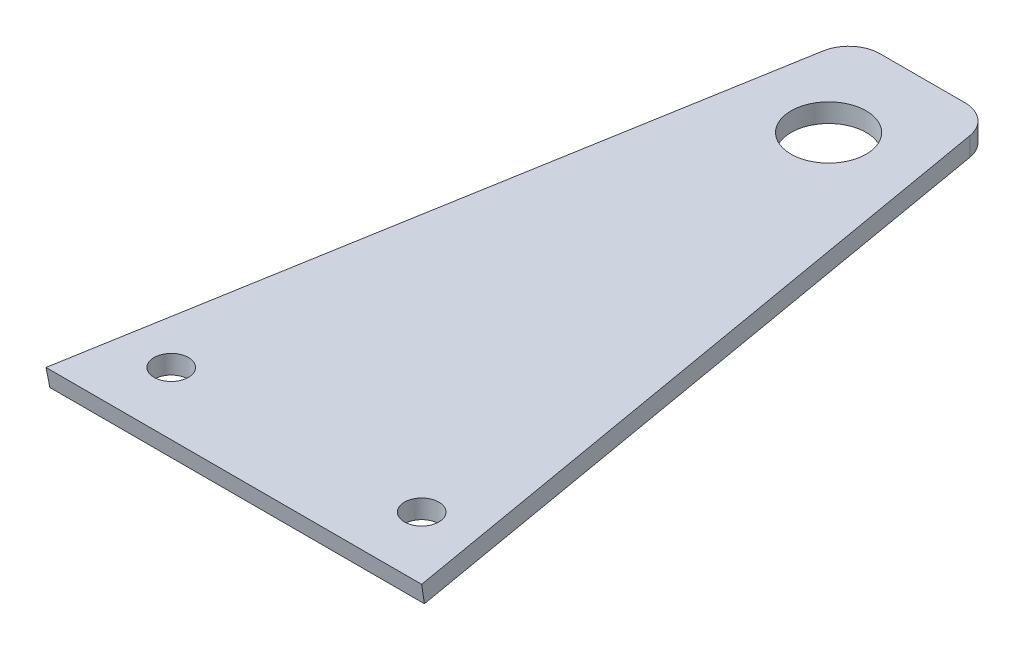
ISO-10303-21;
HEADER;
FILE_DESCRIPTION(('STEP AP214'),'2;1');
FILE_NAME('part.step','',(''),(''),'','','');
FILE_SCHEMA(('AUTOMOTIVE_DESIGN { 1 0 10303 214 1 1 1 1 }'));
ENDSEC;
DATA;
#1=APPLICATION_CONTEXT('core data for automotive mechanical design processes');
#2=APPLICATION_PROTOCOL_DEFINITION('international standard','automotive_design',2000,#1);
#3=PRODUCT_CONTEXT('',#1,'mechanical');
#4=PRODUCT('Part','Part','',(#3));
#5=PRODUCT_RELATED_PRODUCT_CATEGORY('part','',(#4));
#6=PRODUCT_DEFINITION_FORMATION('','',#4);
#7=PRODUCT_DEFINITION_CONTEXT('part definition',#1,'design');
#8=PRODUCT_DEFINITION('design','',#6,#7);
#9=PRODUCT_DEFINITION_SHAPE('','',#8);
#10=(LENGTH_UNIT() NAMED_UNIT(*) SI_UNIT(.MILLI.,.METRE.));
#11=(NAMED_UNIT(*) PLANE_ANGLE_UNIT() SI_UNIT($,.RADIAN.));
#12=(NAMED_UNIT(*) SI_UNIT($,.STERADIAN.) SOLID_ANGLE_UNIT());
#13=UNCERTAINTY_MEASURE_WITH_UNIT(LENGTH_MEASURE(1.E-05),#10,'distance_accuracy_value','');
#14=(GEOMETRIC_REPRESENTATION_CONTEXT(3) GLOBAL_UNCERTAINTY_ASSIGNED_CONTEXT((#13)) GLOBAL_UNIT_ASSIGNED_CONTEXT((#10,
#11,#12)) REPRESENTATION_CONTEXT('',''));
#15=CARTESIAN_POINT('',(0.,0.,0.));
#16=DIRECTION('',(0.,0.,1.));
#17=DIRECTION('',(1.,0.,0.));
#18=AXIS2_PLACEMENT_3D('',#15,#16,#17);
#19=CARTESIAN_POINT('',(36.7895977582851,0.,-105.));
#20=DIRECTION('',(0.,1.,0.));
#21=DIRECTION('',(0.,0.,1.));
#22=AXIS2_PLACEMENT_3D('',#19,#20,#21);
#23=PLANE('',#22);
#24=CARTESIAN_POINT('',(30.,0.,-95.));
#25=DIRECTION('',(0.,1.,0.));
#26=DIRECTION('',(0.,0.,1.));
#27=AXIS2_PLACEMENT_3D('',#24,#25,#26);
#28=CIRCLE('',#27,6.);
#29=CARTESIAN_POINT('',(30.,0.,-89.));
#30=VERTEX_POINT('',#29);
#31=EDGE_CURVE('E88',#30,#30,#28,.T.);
#32=ORIENTED_EDGE('',*,*,#31,.T.);
#33=EDGE_LOOP('',(#32));
#34=FACE_BOUND('',#33,.T.);
#35=CARTESIAN_POINT('',(10.,0.,-10.));
#36=DIRECTION('',(0.,1.,0.));
#37=DIRECTION('',(0.,0.,1.));
#38=AXIS2_PLACEMENT_3D('',#35,#36,#37);
#39=CIRCLE('',#38,2.75);
#40=CARTESIAN_POINT('',(10.,0.,-7.25));
#41=VERTEX_POINT('',#40);
#42=EDGE_CURVE('E154',#41,#41,#39,.T.);
#43=ORIENTED_EDGE('',*,*,#42,.T.);
#44=EDGE_LOOP('',(#43));
#45=FACE_BOUND('',#44,.T.);
#46=CARTESIAN_POINT('',(50.,0.,-10.));
#47=DIRECTION('',(0.,1.,0.));
#48=DIRECTION('',(0.,0.,1.));
#49=AXIS2_PLACEMENT_3D('',#46,#47,#48);
#50=CIRCLE('',#49,2.75);
#51=CARTESIAN_POINT('',(50.,0.,-7.25));
#52=VERTEX_POINT('',#51);
#53=EDGE_CURVE('E148',#52,#52,#50,.T.);
#54=ORIENTED_EDGE('',*,*,#53,.T.);
#55=EDGE_LOOP('',(#54));
#56=FACE_BOUND('',#55,.T.);
#57=DIRECTION('',(1.,0.,0.));
#58=VECTOR('',#57,1.);
#59=CARTESIAN_POINT('',(36.7895977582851,0.,-0.52898094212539));
#60=LINE('',#59,#58);
#61=CARTESIAN_POINT('',(0.0913694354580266,0.,-0.528980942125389));
#62=VERTEX_POINT('',#61);
#63=CARTESIAN_POINT('',(59.908630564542,0.,-0.528980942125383));
#64=VERTEX_POINT('',#63);
#65=EDGE_CURVE('E85',#62,#64,#60,.T.);
#66=ORIENTED_EDGE('',*,*,#65,.F.);
#67=DIRECTION('',(-0.170206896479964,0.,0.985408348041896));
#68=VECTOR('',#67,1.);
#69=CARTESIAN_POINT('',(18.2833605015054,0.,-105.8510344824));
#70=LINE('',#69,#68);
#71=CARTESIAN_POINT('',(18.2833605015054,0.,-105.8510344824));
#72=VERTEX_POINT('',#71);
#73=EDGE_CURVE('E100',#72,#62,#70,.T.);
#74=ORIENTED_EDGE('',*,*,#73,.F.);
#75=CARTESIAN_POINT('',(23.2104022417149,0.,-105.));
#76=DIRECTION('',(0.,1.,0.));
#77=DIRECTION('',(0.,0.,-1.));
#78=AXIS2_PLACEMENT_3D('',#75,#76,#77);
#79=CIRCLE('',#78,5.);
#80=CARTESIAN_POINT('',(23.2104022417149,0.,-110.));
#81=VERTEX_POINT('',#80);
#82=EDGE_CURVE('E103',#81,#72,#79,.T.);
#83=ORIENTED_EDGE('',*,*,#82,.F.);
#84=DIRECTION('',(-1.,0.,0.));
#85=VECTOR('',#84,1.);
#86=CARTESIAN_POINT('',(23.2104022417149,0.,-110.));
#87=LINE('',#86,#85);
#88=CARTESIAN_POINT('',(36.7895977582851,0.,-110.));
#89=VERTEX_POINT('',#88);
#90=EDGE_CURVE('E129',#89,#81,#87,.T.);
#91=ORIENTED_EDGE('',*,*,#90,.F.);
#92=CARTESIAN_POINT('',(36.7895977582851,0.,-105.));
#93=DIRECTION('',(0.,1.,0.));
#94=DIRECTION('',(0.,0.,1.));
#95=AXIS2_PLACEMENT_3D('',#92,#93,#94);
#96=CIRCLE('',#95,5.);
#97=CARTESIAN_POINT('',(41.7166394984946,0.,-105.8510344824));
#98=VERTEX_POINT('',#97);
#99=EDGE_CURVE('E124',#98,#89,#96,.T.);
#100=ORIENTED_EDGE('',*,*,#99,.F.);
#101=DIRECTION('',(-0.170206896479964,0.,-0.985408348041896));
#102=VECTOR('',#101,1.);
#103=CARTESIAN_POINT('',(41.7166394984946,0.,-105.8510344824));
#104=LINE('',#103,#102);
#105=EDGE_CURVE('E127',#64,#98,#104,.T.);
#106=ORIENTED_EDGE('',*,*,#105,.F.);
#107=EDGE_LOOP('',(#66,#74,#83,#91,#100,#106));
#108=FACE_BOUND('',#107,.T.);
#109=ADVANCED_FACE('F30',(#34,#45,#56,#108),#23,.F.);
#110=CARTESIAN_POINT('',(41.7166394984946,3.,-105.8510344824));
#111=DIRECTION('',(-0.985408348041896,0.,0.170206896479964));
#112=DIRECTION('',(0.170206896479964,0.,0.985408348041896));
#113=AXIS2_PLACEMENT_3D('',#110,#111,#112);
#114=PLANE('',#113);
#115=DIRECTION('',(0.0299802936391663,0.984365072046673,0.173570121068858));
#116=VECTOR('',#115,1.);
#117=CARTESIAN_POINT('',(59.4327513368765,-15.6248933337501,-3.28407120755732));
#118=LINE('',#117,#116);
#119=CARTESIAN_POINT('',(60.,3.,0.));
#120=VERTEX_POINT('',#119);
#121=EDGE_CURVE('E81',#64,#120,#118,.T.);
#122=ORIENTED_EDGE('',*,*,#121,.F.);
#123=ORIENTED_EDGE('',*,*,#105,.T.);
#124=DIRECTION('',(0.,-1.,0.));
#125=VECTOR('',#124,1.);
#126=CARTESIAN_POINT('',(41.7166394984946,3.,-105.8510344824));
#127=LINE('',#126,#125);
#128=CARTESIAN_POINT('',(41.7166394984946,3.,-105.8510344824));
#129=VERTEX_POINT('',#128);
#130=EDGE_CURVE('E38',#129,#98,#127,.T.);
#131=ORIENTED_EDGE('',*,*,#130,.F.);
#132=DIRECTION('',(-0.170206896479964,0.,-0.985408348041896));
#133=VECTOR('',#132,1.);
#134=CARTESIAN_POINT('',(41.7166394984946,3.,-105.8510344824));
#135=LINE('',#134,#133);
#136=EDGE_CURVE('E91',#120,#129,#135,.T.);
#137=ORIENTED_EDGE('',*,*,#136,.F.);
#138=EDGE_LOOP('',(#122,#123,#131,#137));
#139=FACE_BOUND('',#138,.T.);
#140=ADVANCED_FACE('F32',(#139),#114,.F.);
#141=CARTESIAN_POINT('',(18.2833605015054,3.,-105.8510344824));
#142=DIRECTION('',(0.985408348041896,0.,0.170206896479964));
#143=DIRECTION('',(0.170206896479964,0.,-0.985408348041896));
#144=AXIS2_PLACEMENT_3D('',#141,#142,#143);
#145=PLANE('',#144);
#146=DIRECTION('',(0.0299802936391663,-0.984365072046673,-0.173570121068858));
#147=VECTOR('',#146,1.);
#148=CARTESIAN_POINT('',(0.567248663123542,-15.6248933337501,-3.28407120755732));
#149=LINE('',#148,#147);
#150=CARTESIAN_POINT('',(0.,3.,0.));
#151=VERTEX_POINT('',#150);
#152=EDGE_CURVE('E11',#151,#62,#149,.T.);
#153=ORIENTED_EDGE('',*,*,#152,.F.);
#154=DIRECTION('',(-0.170206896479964,0.,0.985408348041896));
#155=VECTOR('',#154,1.);
#156=CARTESIAN_POINT('',(18.2833605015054,3.,-105.8510344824));
#157=LINE('',#156,#155);
#158=CARTESIAN_POINT('',(18.2833605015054,3.,-105.8510344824));
#159=VERTEX_POINT('',#158);
#160=EDGE_CURVE('E99',#159,#151,#157,.T.);
#161=ORIENTED_EDGE('',*,*,#160,.F.);
#162=DIRECTION('',(0.,-1.,0.));
#163=VECTOR('',#162,1.);
#164=CARTESIAN_POINT('',(18.2833605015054,3.,-105.8510344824));
#165=LINE('',#164,#163);
#166=EDGE_CURVE('E112',#159,#72,#165,.T.);
#167=ORIENTED_EDGE('',*,*,#166,.T.);
#168=ORIENTED_EDGE('',*,*,#73,.T.);
#169=EDGE_LOOP('',(#153,#161,#167,#168));
#170=FACE_BOUND('',#169,.T.);
#171=ADVANCED_FACE('F140',(#170),#145,.F.);
#172=CARTESIAN_POINT('',(36.7895977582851,3.,-105.));
#173=DIRECTION('',(0.,1.,0.));
#174=DIRECTION('',(0.,0.,1.));
#175=AXIS2_PLACEMENT_3D('',#172,#173,#174);
#176=PLANE('',#175);
#177=CARTESIAN_POINT('',(50.,3.,-10.));
#178=DIRECTION('',(0.,1.,0.));
#179=DIRECTION('',(0.,0.,1.));
#180=AXIS2_PLACEMENT_3D('',#177,#178,#179);
#181=CIRCLE('',#180,2.75);
#182=CARTESIAN_POINT('',(50.,3.,-7.25));
#183=VERTEX_POINT('',#182);
#184=EDGE_CURVE('E151',#183,#183,#181,.T.);
#185=ORIENTED_EDGE('',*,*,#184,.F.);
#186=EDGE_LOOP('',(#185));
#187=FACE_BOUND('',#186,.T.);
#188=DIRECTION('',(1.,0.,0.));
#189=VECTOR('',#188,1.);
#190=CARTESIAN_POINT('',(0.,3.,0.));
#191=LINE('',#190,#189);
#192=EDGE_CURVE('E44',#151,#120,#191,.T.);
#193=ORIENTED_EDGE('',*,*,#192,.T.);
#194=ORIENTED_EDGE('',*,*,#136,.T.);
#195=CARTESIAN_POINT('',(36.7895977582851,3.,-105.));
#196=DIRECTION('',(0.,1.,0.));
#197=DIRECTION('',(0.,0.,1.));
#198=AXIS2_PLACEMENT_3D('',#195,#196,#197);
#199=CIRCLE('',#198,5.);
#200=CARTESIAN_POINT('',(36.7895977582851,3.,-110.));
#201=VERTEX_POINT('',#200);
#202=EDGE_CURVE('E94',#129,#201,#199,.T.);
#203=ORIENTED_EDGE('',*,*,#202,.T.);
#204=DIRECTION('',(-1.,0.,0.));
#205=VECTOR('',#204,1.);
#206=CARTESIAN_POINT('',(23.2104022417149,3.,-110.));
#207=LINE('',#206,#205);
#208=CARTESIAN_POINT('',(23.2104022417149,3.,-110.));
#209=VERTEX_POINT('',#208);
#210=EDGE_CURVE('E108',#201,#209,#207,.T.);
#211=ORIENTED_EDGE('',*,*,#210,.T.);
#212=CARTESIAN_POINT('',(23.2104022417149,3.,-105.));
#213=DIRECTION('',(0.,1.,0.));
#214=DIRECTION('',(0.,0.,-1.));
#215=AXIS2_PLACEMENT_3D('',#212,#213,#214);
#216=CIRCLE('',#215,5.);
#217=EDGE_CURVE('E52',#209,#159,#216,.T.);
#218=ORIENTED_EDGE('',*,*,#217,.T.);
#219=ORIENTED_EDGE('',*,*,#160,.T.);
#220=EDGE_LOOP('',(#193,#194,#203,#211,#218,#219));
#221=FACE_BOUND('',#220,.T.);
#222=CARTESIAN_POINT('',(10.,3.,-10.));
#223=DIRECTION('',(0.,1.,0.));
#224=DIRECTION('',(0.,0.,1.));
#225=AXIS2_PLACEMENT_3D('',#222,#223,#224);
#226=CIRCLE('',#225,2.75);
#227=CARTESIAN_POINT('',(10.,3.,-7.25));
#228=VERTEX_POINT('',#227);
#229=EDGE_CURVE('E132',#228,#228,#226,.T.);
#230=ORIENTED_EDGE('',*,*,#229,.F.);
#231=EDGE_LOOP('',(#230));
#232=FACE_BOUND('',#231,.T.);
#233=CARTESIAN_POINT('',(30.,3.,-95.));
#234=DIRECTION('',(0.,1.,0.));
#235=DIRECTION('',(0.,0.,1.));
#236=AXIS2_PLACEMENT_3D('',#233,#234,#235);
#237=CIRCLE('',#236,6.);
#238=CARTESIAN_POINT('',(30.,3.,-89.));
#239=VERTEX_POINT('',#238);
#240=EDGE_CURVE('E145',#239,#239,#237,.T.);
#241=ORIENTED_EDGE('',*,*,#240,.F.);
#242=EDGE_LOOP('',(#241));
#243=FACE_BOUND('',#242,.T.);
#244=ADVANCED_FACE('F96',(#187,#221,#232,#243),#176,.T.);
#245=CARTESIAN_POINT('',(36.7895977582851,3.,-105.));
#246=DIRECTION('',(0.,-1.,0.));
#247=DIRECTION('',(0.,0.,-1.));
#248=AXIS2_PLACEMENT_3D('',#245,#246,#247);
#249=CYLINDRICAL_SURFACE('',#248,5.);
#250=ORIENTED_EDGE('',*,*,#99,.T.);
#251=DIRECTION('',(0.,-1.,0.));
#252=VECTOR('',#251,1.);
#253=CARTESIAN_POINT('',(36.7895977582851,3.,-110.));
#254=LINE('',#253,#252);
#255=EDGE_CURVE('E118',#201,#89,#254,.T.);
#256=ORIENTED_EDGE('',*,*,#255,.F.);
#257=ORIENTED_EDGE('',*,*,#202,.F.);
#258=ORIENTED_EDGE('',*,*,#130,.T.);
#259=EDGE_LOOP('',(#250,#256,#257,#258));
#260=FACE_BOUND('',#259,.T.);
#261=ADVANCED_FACE('F122',(#260),#249,.T.);
#262=CARTESIAN_POINT('',(23.2104022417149,3.,-110.));
#263=DIRECTION('',(0.,0.,1.));
#264=DIRECTION('',(1.,0.,0.));
#265=AXIS2_PLACEMENT_3D('',#262,#263,#264);
#266=PLANE('',#265);
#267=ORIENTED_EDGE('',*,*,#90,.T.);
#268=DIRECTION('',(0.,-1.,0.));
#269=VECTOR('',#268,1.);
#270=CARTESIAN_POINT('',(23.2104022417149,3.,-110.));
#271=LINE('',#270,#269);
#272=EDGE_CURVE('E115',#209,#81,#271,.T.);
#273=ORIENTED_EDGE('',*,*,#272,.F.);
#274=ORIENTED_EDGE('',*,*,#210,.F.);
#275=ORIENTED_EDGE('',*,*,#255,.T.);
#276=EDGE_LOOP('',(#267,#273,#274,#275));
#277=FACE_BOUND('',#276,.T.);
#278=ADVANCED_FACE('F194',(#277),#266,.F.);
#279=CARTESIAN_POINT('',(23.2104022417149,3.,-105.));
#280=DIRECTION('',(0.,-1.,0.));
#281=DIRECTION('',(0.,0.,-1.));
#282=AXIS2_PLACEMENT_3D('',#279,#280,#281);
#283=CYLINDRICAL_SURFACE('',#282,5.);
#284=ORIENTED_EDGE('',*,*,#82,.T.);
#285=ORIENTED_EDGE('',*,*,#166,.F.);
#286=ORIENTED_EDGE('',*,*,#217,.F.);
#287=ORIENTED_EDGE('',*,*,#272,.T.);
#288=EDGE_LOOP('',(#284,#285,#286,#287));
#289=FACE_BOUND('',#288,.T.);
#290=ADVANCED_FACE('F136',(#289),#283,.T.);
#291=CARTESIAN_POINT('',(10.,3.,-10.));
#292=DIRECTION('',(0.,-1.,0.));
#293=DIRECTION('',(0.,0.,-1.));
#294=AXIS2_PLACEMENT_3D('',#291,#292,#293);
#295=CYLINDRICAL_SURFACE('',#294,2.75);
#296=ORIENTED_EDGE('',*,*,#229,.T.);
#297=EDGE_LOOP('',(#296));
#298=FACE_BOUND('',#297,.T.);
#299=ORIENTED_EDGE('',*,*,#42,.F.);
#300=EDGE_LOOP('',(#299));
#301=FACE_BOUND('',#300,.T.);
#302=ADVANCED_FACE('F159',(#298,#301),#295,.F.);
#303=CARTESIAN_POINT('',(50.,3.,-10.));
#304=DIRECTION('',(0.,-1.,0.));
#305=DIRECTION('',(0.,0.,-1.));
#306=AXIS2_PLACEMENT_3D('',#303,#304,#305);
#307=CYLINDRICAL_SURFACE('',#306,2.75);
#308=ORIENTED_EDGE('',*,*,#184,.T.);
#309=EDGE_LOOP('',(#308));
#310=FACE_BOUND('',#309,.T.);
#311=ORIENTED_EDGE('',*,*,#53,.F.);
#312=EDGE_LOOP('',(#311));
#313=FACE_BOUND('',#312,.T.);
#314=ADVANCED_FACE('F170',(#310,#313),#307,.F.);
#315=CARTESIAN_POINT('',(30.,3.,-95.));
#316=DIRECTION('',(0.,-1.,0.));
#317=DIRECTION('',(0.,0.,-1.));
#318=AXIS2_PLACEMENT_3D('',#315,#316,#317);
#319=CYLINDRICAL_SURFACE('',#318,6.);
#320=ORIENTED_EDGE('',*,*,#240,.T.);
#321=EDGE_LOOP('',(#320));
#322=FACE_BOUND('',#321,.T.);
#323=ORIENTED_EDGE('',*,*,#31,.F.);
#324=EDGE_LOOP('',(#323));
#325=FACE_BOUND('',#324,.T.);
#326=ADVANCED_FACE('F167',(#322,#325),#319,.F.);
#327=CARTESIAN_POINT('',(60.,3.,0.));
#328=DIRECTION('',(0.,-0.173648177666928,0.984807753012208));
#329=DIRECTION('',(0.,-0.984807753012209,-0.173648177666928));
#330=AXIS2_PLACEMENT_3D('',#327,#328,#329);
#331=PLANE('',#330);
#332=ORIENTED_EDGE('',*,*,#121,.T.);
#333=ORIENTED_EDGE('',*,*,#192,.F.);
#334=ORIENTED_EDGE('',*,*,#152,.T.);
#335=ORIENTED_EDGE('',*,*,#65,.T.);
#336=EDGE_LOOP('',(#332,#333,#334,#335));
#337=FACE_BOUND('',#336,.T.);
#338=ADVANCED_FACE('F83',(#337),#331,.T.);
#339=CLOSED_SHELL('',(#109,#140,#171,#244,#261,#278,#290,#302,#314,#326,#338));
#340=MANIFOLD_SOLID_BREP('B2',#339);
#341=ADVANCED_BREP_SHAPE_REPRESENTATION('',(#18,#340),#14);
#342=SHAPE_DEFINITION_REPRESENTATION(#9,#341);
ENDSEC;
END-ISO-10303-21;
